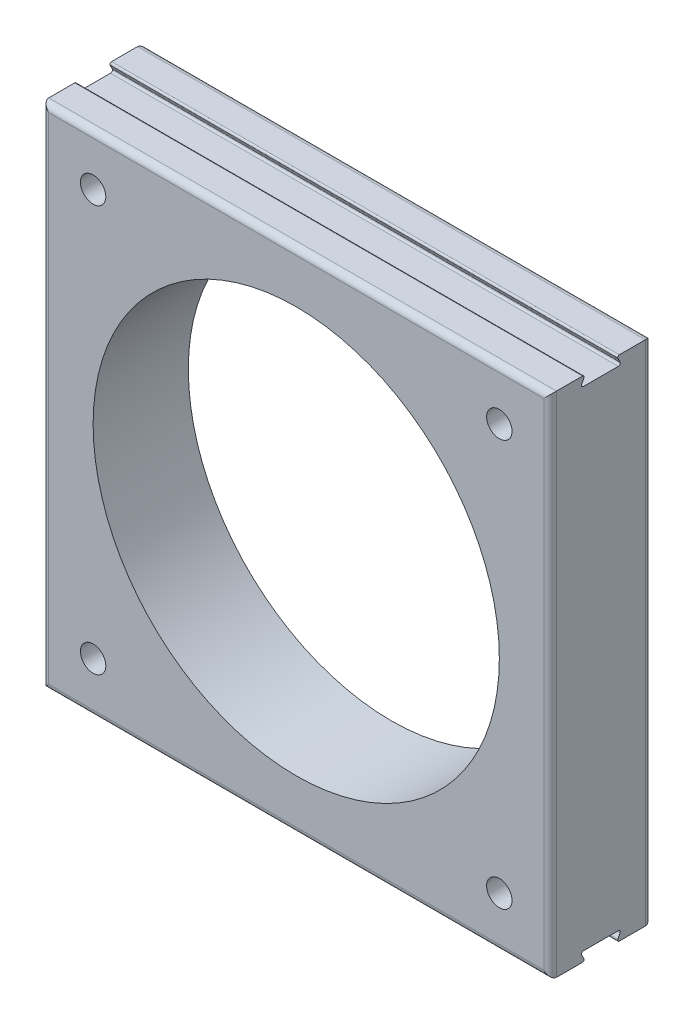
ISO-10303-21;
HEADER;
FILE_DESCRIPTION(('STEP AP214'),'2;1');
FILE_NAME('part.step','',(''),(''),'','','');
FILE_SCHEMA(('AUTOMOTIVE_DESIGN { 1 0 10303 214 1 1 1 1 }'));
ENDSEC;
DATA;
#1=APPLICATION_CONTEXT('core data for automotive mechanical design processes');
#2=APPLICATION_PROTOCOL_DEFINITION('international standard','automotive_design',2000,#1);
#3=PRODUCT_CONTEXT('',#1,'mechanical');
#4=PRODUCT('Part','Part','',(#3));
#5=PRODUCT_RELATED_PRODUCT_CATEGORY('part','',(#4));
#6=PRODUCT_DEFINITION_FORMATION('','',#4);
#7=PRODUCT_DEFINITION_CONTEXT('part definition',#1,'design');
#8=PRODUCT_DEFINITION('design','',#6,#7);
#9=PRODUCT_DEFINITION_SHAPE('','',#8);
#10=(LENGTH_UNIT() NAMED_UNIT(*) SI_UNIT(.MILLI.,.METRE.));
#11=(NAMED_UNIT(*) PLANE_ANGLE_UNIT() SI_UNIT($,.RADIAN.));
#12=(NAMED_UNIT(*) SI_UNIT($,.STERADIAN.) SOLID_ANGLE_UNIT());
#13=UNCERTAINTY_MEASURE_WITH_UNIT(LENGTH_MEASURE(1.E-05),#10,'distance_accuracy_value','');
#14=(GEOMETRIC_REPRESENTATION_CONTEXT(3) GLOBAL_UNCERTAINTY_ASSIGNED_CONTEXT((#13)) GLOBAL_UNIT_ASSIGNED_CONTEXT((#10,
#11,#12)) REPRESENTATION_CONTEXT('',''));
#15=CARTESIAN_POINT('',(0.,0.,0.));
#16=DIRECTION('',(0.,0.,1.));
#17=DIRECTION('',(1.,0.,0.));
#18=AXIS2_PLACEMENT_3D('',#15,#16,#17);
#19=CARTESIAN_POINT('',(-127.,127.,25.4));
#20=DIRECTION('',(0.,0.,1.));
#21=DIRECTION('',(1.,0.,0.));
#22=AXIS2_PLACEMENT_3D('',#19,#20,#21);
#23=PLANE('',#22);
#24=CARTESIAN_POINT('',(0.,0.,25.4));
#25=DIRECTION('',(0.,0.,-1.));
#26=DIRECTION('',(-1.,0.,0.));
#27=AXIS2_PLACEMENT_3D('',#24,#25,#26);
#28=CIRCLE('',#27,101.6);
#29=CARTESIAN_POINT('',(-101.6,0.,25.4));
#30=VERTEX_POINT('',#29);
#31=EDGE_CURVE('E454',#30,#30,#28,.T.);
#32=ORIENTED_EDGE('',*,*,#31,.T.);
#33=EDGE_LOOP('',(#32));
#34=FACE_BOUND('',#33,.T.);
#35=CARTESIAN_POINT('',(101.6,-101.6,25.4));
#36=DIRECTION('',(0.,0.,1.));
#37=DIRECTION('',(-1.,0.,0.));
#38=AXIS2_PLACEMENT_3D('',#35,#36,#37);
#39=CIRCLE('',#38,6.34999999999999);
#40=CARTESIAN_POINT('',(95.25,-101.6,25.4));
#41=VERTEX_POINT('',#40);
#42=EDGE_CURVE('E442',#41,#41,#39,.T.);
#43=ORIENTED_EDGE('',*,*,#42,.F.);
#44=EDGE_LOOP('',(#43));
#45=FACE_BOUND('',#44,.T.);
#46=CARTESIAN_POINT('',(-101.6,-101.6,25.4));
#47=DIRECTION('',(0.,0.,-1.));
#48=DIRECTION('',(1.,0.,0.));
#49=AXIS2_PLACEMENT_3D('',#46,#47,#48);
#50=CIRCLE('',#49,6.34999999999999);
#51=CARTESIAN_POINT('',(-95.25,-101.6,25.4));
#52=VERTEX_POINT('',#51);
#53=EDGE_CURVE('E430',#52,#52,#50,.T.);
#54=ORIENTED_EDGE('',*,*,#53,.T.);
#55=EDGE_LOOP('',(#54));
#56=FACE_BOUND('',#55,.T.);
#57=CARTESIAN_POINT('',(-101.6,101.6,25.4));
#58=DIRECTION('',(0.,0.,1.));
#59=DIRECTION('',(1.,0.,0.));
#60=AXIS2_PLACEMENT_3D('',#57,#58,#59);
#61=CIRCLE('',#60,6.34999999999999);
#62=CARTESIAN_POINT('',(-95.25,101.6,25.4));
#63=VERTEX_POINT('',#62);
#64=EDGE_CURVE('E424',#63,#63,#61,.T.);
#65=ORIENTED_EDGE('',*,*,#64,.F.);
#66=EDGE_LOOP('',(#65));
#67=FACE_BOUND('',#66,.T.);
#68=DIRECTION('',(0.,1.,0.));
#69=VECTOR('',#68,1.);
#70=CARTESIAN_POINT('',(123.825,127.,25.4));
#71=LINE('',#70,#69);
#72=CARTESIAN_POINT('',(123.825,-123.825,25.4));
#73=VERTEX_POINT('',#72);
#74=CARTESIAN_POINT('',(123.825,123.825,25.4));
#75=VERTEX_POINT('',#74);
#76=EDGE_CURVE('E336',#73,#75,#71,.T.);
#77=ORIENTED_EDGE('',*,*,#76,.T.);
#78=DIRECTION('',(1.,0.,0.));
#79=VECTOR('',#78,1.);
#80=CARTESIAN_POINT('',(-127.,123.825,25.4));
#81=LINE('',#80,#79);
#82=CARTESIAN_POINT('',(-123.825,123.825,25.4));
#83=VERTEX_POINT('',#82);
#84=EDGE_CURVE('E338',#75,#83,#81,.F.);
#85=ORIENTED_EDGE('',*,*,#84,.T.);
#86=DIRECTION('',(0.,-1.,0.));
#87=VECTOR('',#86,1.);
#88=CARTESIAN_POINT('',(-123.825,-127.,25.4));
#89=LINE('',#88,#87);
#90=CARTESIAN_POINT('',(-123.825,-123.825,25.4));
#91=VERTEX_POINT('',#90);
#92=EDGE_CURVE('E332',#83,#91,#89,.T.);
#93=ORIENTED_EDGE('',*,*,#92,.T.);
#94=DIRECTION('',(-1.,0.,0.));
#95=VECTOR('',#94,1.);
#96=CARTESIAN_POINT('',(-127.,-123.825,25.4));
#97=LINE('',#96,#95);
#98=EDGE_CURVE('E334',#91,#73,#97,.F.);
#99=ORIENTED_EDGE('',*,*,#98,.T.);
#100=EDGE_LOOP('',(#77,#85,#93,#99));
#101=FACE_BOUND('',#100,.T.);
#102=CARTESIAN_POINT('',(101.6,101.6,25.4));
#103=DIRECTION('',(0.,0.,-1.));
#104=DIRECTION('',(-1.,0.,0.));
#105=AXIS2_PLACEMENT_3D('',#102,#103,#104);
#106=CIRCLE('',#105,6.34999999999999);
#107=CARTESIAN_POINT('',(95.25,101.6,25.4));
#108=VERTEX_POINT('',#107);
#109=EDGE_CURVE('E436',#108,#108,#106,.T.);
#110=ORIENTED_EDGE('',*,*,#109,.T.);
#111=EDGE_LOOP('',(#110));
#112=FACE_BOUND('',#111,.T.);
#113=ADVANCED_FACE('F28',(#34,#45,#56,#67,#101,#112),#23,.T.);
#114=CARTESIAN_POINT('',(-127.,127.,-25.4));
#115=DIRECTION('',(0.,0.,1.));
#116=DIRECTION('',(1.,0.,0.));
#117=AXIS2_PLACEMENT_3D('',#114,#115,#116);
#118=PLANE('',#117);
#119=CARTESIAN_POINT('',(0.,0.,-25.4));
#120=DIRECTION('',(0.,0.,-1.));
#121=DIRECTION('',(-1.,0.,0.));
#122=AXIS2_PLACEMENT_3D('',#119,#120,#121);
#123=CIRCLE('',#122,107.95);
#124=CARTESIAN_POINT('',(-107.95,0.,-25.4));
#125=VERTEX_POINT('',#124);
#126=EDGE_CURVE('E448',#125,#125,#123,.T.);
#127=ORIENTED_EDGE('',*,*,#126,.F.);
#128=EDGE_LOOP('',(#127));
#129=FACE_BOUND('',#128,.T.);
#130=CARTESIAN_POINT('',(101.6,-101.6,-25.4));
#131=DIRECTION('',(0.,0.,1.));
#132=DIRECTION('',(-1.,0.,0.));
#133=AXIS2_PLACEMENT_3D('',#130,#131,#132);
#134=CIRCLE('',#133,6.34999999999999);
#135=CARTESIAN_POINT('',(95.25,-101.6,-25.4));
#136=VERTEX_POINT('',#135);
#137=EDGE_CURVE('E439',#136,#136,#134,.T.);
#138=ORIENTED_EDGE('',*,*,#137,.T.);
#139=EDGE_LOOP('',(#138));
#140=FACE_BOUND('',#139,.T.);
#141=CARTESIAN_POINT('',(-101.6,-101.6,-25.4));
#142=DIRECTION('',(0.,0.,-1.));
#143=DIRECTION('',(1.,0.,0.));
#144=AXIS2_PLACEMENT_3D('',#141,#142,#143);
#145=CIRCLE('',#144,6.34999999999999);
#146=CARTESIAN_POINT('',(-95.25,-101.6,-25.4));
#147=VERTEX_POINT('',#146);
#148=EDGE_CURVE('E427',#147,#147,#145,.T.);
#149=ORIENTED_EDGE('',*,*,#148,.F.);
#150=EDGE_LOOP('',(#149));
#151=FACE_BOUND('',#150,.T.);
#152=CARTESIAN_POINT('',(-101.6,101.6,-25.4));
#153=DIRECTION('',(0.,0.,1.));
#154=DIRECTION('',(1.,0.,0.));
#155=AXIS2_PLACEMENT_3D('',#152,#153,#154);
#156=CIRCLE('',#155,6.34999999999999);
#157=CARTESIAN_POINT('',(-95.25,101.6,-25.4));
#158=VERTEX_POINT('',#157);
#159=EDGE_CURVE('E421',#158,#158,#156,.T.);
#160=ORIENTED_EDGE('',*,*,#159,.T.);
#161=EDGE_LOOP('',(#160));
#162=FACE_BOUND('',#161,.T.);
#163=DIRECTION('',(0.,1.,0.));
#164=VECTOR('',#163,1.);
#165=CARTESIAN_POINT('',(123.825,127.,-25.4));
#166=LINE('',#165,#164);
#167=CARTESIAN_POINT('',(123.825,123.825,-25.4));
#168=VERTEX_POINT('',#167);
#169=CARTESIAN_POINT('',(123.825,-123.825,-25.4));
#170=VERTEX_POINT('',#169);
#171=EDGE_CURVE('E43',#168,#170,#166,.F.);
#172=ORIENTED_EDGE('',*,*,#171,.T.);
#173=DIRECTION('',(-1.,0.,0.));
#174=VECTOR('',#173,1.);
#175=CARTESIAN_POINT('',(-127.,-123.825,-25.4));
#176=LINE('',#175,#174);
#177=CARTESIAN_POINT('',(-123.825,-123.825,-25.4));
#178=VERTEX_POINT('',#177);
#179=EDGE_CURVE('E355',#170,#178,#176,.T.);
#180=ORIENTED_EDGE('',*,*,#179,.T.);
#181=DIRECTION('',(0.,-1.,0.));
#182=VECTOR('',#181,1.);
#183=CARTESIAN_POINT('',(-123.825,127.,-25.4));
#184=LINE('',#183,#182);
#185=CARTESIAN_POINT('',(-123.825,123.825,-25.4));
#186=VERTEX_POINT('',#185);
#187=EDGE_CURVE('E351',#178,#186,#184,.F.);
#188=ORIENTED_EDGE('',*,*,#187,.T.);
#189=DIRECTION('',(1.,0.,0.));
#190=VECTOR('',#189,1.);
#191=CARTESIAN_POINT('',(127.,123.825,-25.4));
#192=LINE('',#191,#190);
#193=EDGE_CURVE('E48',#186,#168,#192,.T.);
#194=ORIENTED_EDGE('',*,*,#193,.T.);
#195=EDGE_LOOP('',(#172,#180,#188,#194));
#196=FACE_BOUND('',#195,.T.);
#197=CARTESIAN_POINT('',(101.6,101.6,-25.4));
#198=DIRECTION('',(0.,0.,-1.));
#199=DIRECTION('',(-1.,0.,0.));
#200=AXIS2_PLACEMENT_3D('',#197,#198,#199);
#201=CIRCLE('',#200,6.34999999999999);
#202=CARTESIAN_POINT('',(95.25,101.6,-25.4));
#203=VERTEX_POINT('',#202);
#204=EDGE_CURVE('E433',#203,#203,#201,.T.);
#205=ORIENTED_EDGE('',*,*,#204,.F.);
#206=EDGE_LOOP('',(#205));
#207=FACE_BOUND('',#206,.T.);
#208=ADVANCED_FACE('F472',(#129,#140,#151,#162,#196,#207),#118,.F.);
#209=CARTESIAN_POINT('',(-127.,127.,25.4));
#210=DIRECTION('',(1.,0.,0.));
#211=DIRECTION('',(0.,0.,-1.));
#212=AXIS2_PLACEMENT_3D('',#209,#210,#211);
#213=PLANE('',#212);
#214=DIRECTION('',(0.,0.,-1.));
#215=VECTOR('',#214,1.);
#216=CARTESIAN_POINT('',(-127.,-127.,25.4));
#217=LINE('',#216,#215);
#218=CARTESIAN_POINT('',(-127.,-127.,22.225));
#219=VERTEX_POINT('',#218);
#220=CARTESIAN_POINT('',(-127.,-127.,9.20803888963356));
#221=VERTEX_POINT('',#220);
#222=EDGE_CURVE('E307',#219,#221,#217,.T.);
#223=ORIENTED_EDGE('',*,*,#222,.F.);
#224=DIRECTION('',(0.,-1.,0.));
#225=VECTOR('',#224,1.);
#226=CARTESIAN_POINT('',(-127.,127.,22.225));
#227=LINE('',#226,#225);
#228=CARTESIAN_POINT('',(-127.,127.,22.225));
#229=VERTEX_POINT('',#228);
#230=EDGE_CURVE('E349',#219,#229,#227,.F.);
#231=ORIENTED_EDGE('',*,*,#230,.T.);
#232=DIRECTION('',(0.,0.,-1.));
#233=VECTOR('',#232,1.);
#234=CARTESIAN_POINT('',(-127.,127.,25.4));
#235=LINE('',#234,#233);
#236=CARTESIAN_POINT('',(-127.,127.,9.20803888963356));
#237=VERTEX_POINT('',#236);
#238=EDGE_CURVE('E299',#229,#237,#235,.T.);
#239=ORIENTED_EDGE('',*,*,#238,.T.);
#240=CARTESIAN_POINT('',(-127.,126.20625,9.20803888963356));
#241=DIRECTION('',(1.,0.,0.));
#242=DIRECTION('',(0.,0.,-1.));
#243=AXIS2_PLACEMENT_3D('',#240,#241,#242);
#244=CIRCLE('',#243,0.79375);
#245=CARTESIAN_POINT('',(-127.,125.858154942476,8.49468841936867));
#246=VERTEX_POINT('',#245);
#247=EDGE_CURVE('E322',#237,#246,#244,.F.);
#248=ORIENTED_EDGE('',*,*,#247,.T.);
#249=DIRECTION('',(0.,-0.898709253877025,0.438544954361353));
#250=VECTOR('',#249,1.);
#251=CARTESIAN_POINT('',(-127.,127.,7.9375));
#252=LINE('',#251,#250);
#253=CARTESIAN_POINT('',(-127.,123.612719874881,9.59039786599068));
#254=VERTEX_POINT('',#253);
#255=EDGE_CURVE('E277',#246,#254,#252,.T.);
#256=ORIENTED_EDGE('',*,*,#255,.T.);
#257=CARTESIAN_POINT('',(-127.,123.193479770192,8.73125));
#258=DIRECTION('',(1.,0.,0.));
#259=DIRECTION('',(0.,0.,-1.));
#260=AXIS2_PLACEMENT_3D('',#257,#258,#259);
#261=CIRCLE('',#260,0.955979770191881);
#262=CARTESIAN_POINT('',(-127.,122.2375,8.73125));
#263=VERTEX_POINT('',#262);
#264=EDGE_CURVE('E279',#254,#263,#261,.T.);
#265=ORIENTED_EDGE('',*,*,#264,.T.);
#266=DIRECTION('',(0.,0.,1.));
#267=VECTOR('',#266,1.);
#268=CARTESIAN_POINT('',(-127.,122.2375,-8.73125));
#269=LINE('',#268,#267);
#270=CARTESIAN_POINT('',(-127.,122.2375,-8.73125));
#271=VERTEX_POINT('',#270);
#272=EDGE_CURVE('E282',#271,#263,#269,.T.);
#273=ORIENTED_EDGE('',*,*,#272,.F.);
#274=CARTESIAN_POINT('',(-127.,123.193479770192,-8.73125));
#275=DIRECTION('',(-1.,0.,0.));
#276=DIRECTION('',(0.,0.,1.));
#277=AXIS2_PLACEMENT_3D('',#274,#275,#276);
#278=CIRCLE('',#277,0.955979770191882);
#279=CARTESIAN_POINT('',(-127.,123.612719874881,-9.59039786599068));
#280=VERTEX_POINT('',#279);
#281=EDGE_CURVE('E284',#280,#271,#278,.T.);
#282=ORIENTED_EDGE('',*,*,#281,.F.);
#283=DIRECTION('',(0.,-0.898709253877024,-0.438544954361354));
#284=VECTOR('',#283,1.);
#285=CARTESIAN_POINT('',(-127.,127.,-7.9375));
#286=LINE('',#285,#284);
#287=CARTESIAN_POINT('',(-127.,125.858154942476,-8.49468841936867));
#288=VERTEX_POINT('',#287);
#289=EDGE_CURVE('E286',#288,#280,#286,.T.);
#290=ORIENTED_EDGE('',*,*,#289,.F.);
#291=CARTESIAN_POINT('',(-127.,126.20625,-9.20803888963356));
#292=DIRECTION('',(1.,0.,0.));
#293=DIRECTION('',(0.,0.,-1.));
#294=AXIS2_PLACEMENT_3D('',#291,#292,#293);
#295=CIRCLE('',#294,0.79375);
#296=CARTESIAN_POINT('',(-127.,127.,-9.20803888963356));
#297=VERTEX_POINT('',#296);
#298=EDGE_CURVE('E320',#288,#297,#295,.F.);
#299=ORIENTED_EDGE('',*,*,#298,.T.);
#300=CARTESIAN_POINT('',(-127.,127.,-22.225));
#301=VERTEX_POINT('',#300);
#302=EDGE_CURVE('E292',#297,#301,#235,.T.);
#303=ORIENTED_EDGE('',*,*,#302,.T.);
#304=DIRECTION('',(0.,-1.,0.));
#305=VECTOR('',#304,1.);
#306=CARTESIAN_POINT('',(-127.,127.,-22.225));
#307=LINE('',#306,#305);
#308=CARTESIAN_POINT('',(-127.,-127.,-22.225));
#309=VERTEX_POINT('',#308);
#310=EDGE_CURVE('E347',#301,#309,#307,.T.);
#311=ORIENTED_EDGE('',*,*,#310,.T.);
#312=CARTESIAN_POINT('',(-127.,-127.,-9.20803888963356));
#313=VERTEX_POINT('',#312);
#314=EDGE_CURVE('E211',#313,#309,#217,.T.);
#315=ORIENTED_EDGE('',*,*,#314,.F.);
#316=CARTESIAN_POINT('',(-127.,-126.20625,-9.20803888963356));
#317=DIRECTION('',(-1.,0.,0.));
#318=DIRECTION('',(0.,0.,-1.));
#319=AXIS2_PLACEMENT_3D('',#316,#317,#318);
#320=CIRCLE('',#319,0.79375);
#321=CARTESIAN_POINT('',(-127.,-125.858154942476,-8.49468841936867));
#322=VERTEX_POINT('',#321);
#323=EDGE_CURVE('E191',#322,#313,#320,.F.);
#324=ORIENTED_EDGE('',*,*,#323,.F.);
#325=DIRECTION('',(0.,0.898709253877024,-0.438544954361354));
#326=VECTOR('',#325,1.);
#327=CARTESIAN_POINT('',(-127.,-127.,-7.9375));
#328=LINE('',#327,#326);
#329=CARTESIAN_POINT('',(-127.,-123.612719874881,-9.59039786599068));
#330=VERTEX_POINT('',#329);
#331=EDGE_CURVE('E200',#322,#330,#328,.T.);
#332=ORIENTED_EDGE('',*,*,#331,.T.);
#333=CARTESIAN_POINT('',(-127.,-123.193479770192,-8.73125));
#334=DIRECTION('',(1.,0.,0.));
#335=DIRECTION('',(0.,0.,1.));
#336=AXIS2_PLACEMENT_3D('',#333,#334,#335);
#337=CIRCLE('',#336,0.955979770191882);
#338=CARTESIAN_POINT('',(-127.,-122.2375,-8.73125));
#339=VERTEX_POINT('',#338);
#340=EDGE_CURVE('E227',#330,#339,#337,.T.);
#341=ORIENTED_EDGE('',*,*,#340,.T.);
#342=DIRECTION('',(0.,0.,1.));
#343=VECTOR('',#342,1.);
#344=CARTESIAN_POINT('',(-127.,-122.2375,-8.73125));
#345=LINE('',#344,#343);
#346=CARTESIAN_POINT('',(-127.,-122.2375,8.73125));
#347=VERTEX_POINT('',#346);
#348=EDGE_CURVE('E234',#339,#347,#345,.T.);
#349=ORIENTED_EDGE('',*,*,#348,.T.);
#350=CARTESIAN_POINT('',(-127.,-123.193479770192,8.73125));
#351=DIRECTION('',(-1.,0.,0.));
#352=DIRECTION('',(0.,0.,-1.));
#353=AXIS2_PLACEMENT_3D('',#350,#351,#352);
#354=CIRCLE('',#353,0.955979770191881);
#355=CARTESIAN_POINT('',(-127.,-123.612719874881,9.59039786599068));
#356=VERTEX_POINT('',#355);
#357=EDGE_CURVE('E242',#356,#347,#354,.T.);
#358=ORIENTED_EDGE('',*,*,#357,.F.);
#359=DIRECTION('',(0.,0.898709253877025,0.438544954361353));
#360=VECTOR('',#359,1.);
#361=CARTESIAN_POINT('',(-127.,-127.,7.9375));
#362=LINE('',#361,#360);
#363=CARTESIAN_POINT('',(-127.,-125.858154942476,8.49468841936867));
#364=VERTEX_POINT('',#363);
#365=EDGE_CURVE('E247',#364,#356,#362,.T.);
#366=ORIENTED_EDGE('',*,*,#365,.F.);
#367=CARTESIAN_POINT('',(-127.,-126.20625,9.20803888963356));
#368=DIRECTION('',(-1.,0.,0.));
#369=DIRECTION('',(0.,0.,-1.));
#370=AXIS2_PLACEMENT_3D('',#367,#368,#369);
#371=CIRCLE('',#370,0.79375);
#372=EDGE_CURVE('E255',#221,#364,#371,.F.);
#373=ORIENTED_EDGE('',*,*,#372,.F.);
#374=EDGE_LOOP('',(#223,#231,#239,#248,#256,#265,#273,#282,#290,#299,#303,#311,#315,#324,#332,
#341,#349,#358,#366,#373));
#375=FACE_BOUND('',#374,.T.);
#376=ADVANCED_FACE('F30',(#375),#213,.F.);
#377=CARTESIAN_POINT('',(127.,-127.,25.4));
#378=DIRECTION('',(0.,-1.,0.));
#379=DIRECTION('',(1.,0.,0.));
#380=AXIS2_PLACEMENT_3D('',#377,#378,#379);
#381=PLANE('',#380);
#382=DIRECTION('',(0.,0.,-1.));
#383=VECTOR('',#382,1.);
#384=CARTESIAN_POINT('',(127.,-127.,25.4));
#385=LINE('',#384,#383);
#386=CARTESIAN_POINT('',(127.,-127.,22.225));
#387=VERTEX_POINT('',#386);
#388=CARTESIAN_POINT('',(127.,-127.,9.20803888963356));
#389=VERTEX_POINT('',#388);
#390=EDGE_CURVE('E305',#387,#389,#385,.T.);
#391=ORIENTED_EDGE('',*,*,#390,.F.);
#392=DIRECTION('',(-1.,0.,0.));
#393=VECTOR('',#392,1.);
#394=CARTESIAN_POINT('',(127.,-127.,22.225));
#395=LINE('',#394,#393);
#396=EDGE_CURVE('E345',#387,#219,#395,.T.);
#397=ORIENTED_EDGE('',*,*,#396,.T.);
#398=ORIENTED_EDGE('',*,*,#222,.T.);
#399=DIRECTION('',(1.,0.,0.));
#400=VECTOR('',#399,1.);
#401=CARTESIAN_POINT('',(-127.,-127.,9.20803888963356));
#402=LINE('',#401,#400);
#403=EDGE_CURVE('E258',#389,#221,#402,.F.);
#404=ORIENTED_EDGE('',*,*,#403,.F.);
#405=EDGE_LOOP('',(#391,#397,#398,#404));
#406=FACE_BOUND('',#405,.T.);
#407=ADVANCED_FACE('F393',(#406),#381,.T.);
#408=CARTESIAN_POINT('',(127.,-127.,25.4));
#409=DIRECTION('',(-1.,0.,0.));
#410=DIRECTION('',(0.,0.,1.));
#411=AXIS2_PLACEMENT_3D('',#408,#409,#410);
#412=PLANE('',#411);
#413=DIRECTION('',(0.,0.,-1.));
#414=VECTOR('',#413,1.);
#415=CARTESIAN_POINT('',(127.,127.,25.4));
#416=LINE('',#415,#414);
#417=CARTESIAN_POINT('',(127.,127.,22.225));
#418=VERTEX_POINT('',#417);
#419=CARTESIAN_POINT('',(127.,127.,9.20803888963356));
#420=VERTEX_POINT('',#419);
#421=EDGE_CURVE('E302',#418,#420,#416,.T.);
#422=ORIENTED_EDGE('',*,*,#421,.F.);
#423=DIRECTION('',(0.,1.,0.));
#424=VECTOR('',#423,1.);
#425=CARTESIAN_POINT('',(127.,-127.,22.225));
#426=LINE('',#425,#424);
#427=EDGE_CURVE('E343',#418,#387,#426,.F.);
#428=ORIENTED_EDGE('',*,*,#427,.T.);
#429=ORIENTED_EDGE('',*,*,#390,.T.);
#430=CARTESIAN_POINT('',(127.,-126.20625,9.20803888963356));
#431=DIRECTION('',(1.,0.,0.));
#432=DIRECTION('',(0.,0.,1.));
#433=AXIS2_PLACEMENT_3D('',#430,#431,#432);
#434=CIRCLE('',#433,0.79375);
#435=CARTESIAN_POINT('',(127.,-125.858154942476,8.49468841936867));
#436=VERTEX_POINT('',#435);
#437=EDGE_CURVE('E261',#436,#389,#434,.F.);
#438=ORIENTED_EDGE('',*,*,#437,.F.);
#439=DIRECTION('',(0.,0.898709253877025,0.438544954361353));
#440=VECTOR('',#439,1.);
#441=CARTESIAN_POINT('',(127.,-127.,7.9375));
#442=LINE('',#441,#440);
#443=CARTESIAN_POINT('',(127.,-123.612719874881,9.59039786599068));
#444=VERTEX_POINT('',#443);
#445=EDGE_CURVE('E252',#436,#444,#442,.T.);
#446=ORIENTED_EDGE('',*,*,#445,.T.);
#447=CARTESIAN_POINT('',(127.,-123.193479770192,8.73125));
#448=DIRECTION('',(-1.,0.,0.));
#449=DIRECTION('',(0.,0.,-1.));
#450=AXIS2_PLACEMENT_3D('',#447,#448,#449);
#451=CIRCLE('',#450,0.955979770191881);
#452=CARTESIAN_POINT('',(127.,-122.2375,8.73125));
#453=VERTEX_POINT('',#452);
#454=EDGE_CURVE('E239',#444,#453,#451,.T.);
#455=ORIENTED_EDGE('',*,*,#454,.T.);
#456=DIRECTION('',(0.,0.,1.));
#457=VECTOR('',#456,1.);
#458=CARTESIAN_POINT('',(127.,-122.2375,-8.73125));
#459=LINE('',#458,#457);
#460=CARTESIAN_POINT('',(127.,-122.2375,-8.73125));
#461=VERTEX_POINT('',#460);
#462=EDGE_CURVE('E231',#461,#453,#459,.T.);
#463=ORIENTED_EDGE('',*,*,#462,.F.);
#464=CARTESIAN_POINT('',(127.,-123.193479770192,-8.73125));
#465=DIRECTION('',(1.,0.,0.));
#466=DIRECTION('',(0.,0.,1.));
#467=AXIS2_PLACEMENT_3D('',#464,#465,#466);
#468=CIRCLE('',#467,0.955979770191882);
#469=CARTESIAN_POINT('',(127.,-123.612719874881,-9.59039786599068));
#470=VERTEX_POINT('',#469);
#471=EDGE_CURVE('E224',#470,#461,#468,.T.);
#472=ORIENTED_EDGE('',*,*,#471,.F.);
#473=DIRECTION('',(0.,0.898709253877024,-0.438544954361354));
#474=VECTOR('',#473,1.);
#475=CARTESIAN_POINT('',(127.,-127.,-7.9375));
#476=LINE('',#475,#474);
#477=CARTESIAN_POINT('',(127.,-125.858154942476,-8.49468841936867));
#478=VERTEX_POINT('',#477);
#479=EDGE_CURVE('E206',#478,#470,#476,.T.);
#480=ORIENTED_EDGE('',*,*,#479,.F.);
#481=CARTESIAN_POINT('',(127.,-126.20625,-9.20803888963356));
#482=DIRECTION('',(1.,0.,0.));
#483=DIRECTION('',(0.,0.,1.));
#484=AXIS2_PLACEMENT_3D('',#481,#482,#483);
#485=CIRCLE('',#484,0.79375);
#486=CARTESIAN_POINT('',(127.,-127.,-9.20803888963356));
#487=VERTEX_POINT('',#486);
#488=EDGE_CURVE('E194',#487,#478,#485,.F.);
#489=ORIENTED_EDGE('',*,*,#488,.F.);
#490=CARTESIAN_POINT('',(127.,-127.,-22.225));
#491=VERTEX_POINT('',#490);
#492=EDGE_CURVE('E304',#487,#491,#385,.T.);
#493=ORIENTED_EDGE('',*,*,#492,.T.);
#494=DIRECTION('',(0.,1.,0.));
#495=VECTOR('',#494,1.);
#496=CARTESIAN_POINT('',(127.,-127.,-22.225));
#497=LINE('',#496,#495);
#498=CARTESIAN_POINT('',(127.,127.,-22.225));
#499=VERTEX_POINT('',#498);
#500=EDGE_CURVE('E341',#491,#499,#497,.T.);
#501=ORIENTED_EDGE('',*,*,#500,.T.);
#502=CARTESIAN_POINT('',(127.,127.,-9.20803888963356));
#503=VERTEX_POINT('',#502);
#504=EDGE_CURVE('E301',#503,#499,#416,.T.);
#505=ORIENTED_EDGE('',*,*,#504,.F.);
#506=CARTESIAN_POINT('',(127.,126.20625,-9.20803888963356));
#507=DIRECTION('',(-1.,0.,0.));
#508=DIRECTION('',(0.,0.,1.));
#509=AXIS2_PLACEMENT_3D('',#506,#507,#508);
#510=CIRCLE('',#509,0.79375);
#511=CARTESIAN_POINT('',(127.,125.858154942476,-8.49468841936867));
#512=VERTEX_POINT('',#511);
#513=EDGE_CURVE('E312',#503,#512,#510,.F.);
#514=ORIENTED_EDGE('',*,*,#513,.T.);
#515=DIRECTION('',(0.,-0.898709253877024,-0.438544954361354));
#516=VECTOR('',#515,1.);
#517=CARTESIAN_POINT('',(127.,127.,-7.9375));
#518=LINE('',#517,#516);
#519=CARTESIAN_POINT('',(127.,123.612719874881,-9.59039786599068));
#520=VERTEX_POINT('',#519);
#521=EDGE_CURVE('E275',#512,#520,#518,.T.);
#522=ORIENTED_EDGE('',*,*,#521,.T.);
#523=CARTESIAN_POINT('',(127.,123.193479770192,-8.73125));
#524=DIRECTION('',(-1.,0.,0.));
#525=DIRECTION('',(0.,0.,1.));
#526=AXIS2_PLACEMENT_3D('',#523,#524,#525);
#527=CIRCLE('',#526,0.955979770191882);
#528=CARTESIAN_POINT('',(127.,122.2375,-8.73125));
#529=VERTEX_POINT('',#528);
#530=EDGE_CURVE('E272',#520,#529,#527,.T.);
#531=ORIENTED_EDGE('',*,*,#530,.T.);
#532=DIRECTION('',(0.,0.,1.));
#533=VECTOR('',#532,1.);
#534=CARTESIAN_POINT('',(127.,122.2375,-8.73125));
#535=LINE('',#534,#533);
#536=CARTESIAN_POINT('',(127.,122.2375,8.73125));
#537=VERTEX_POINT('',#536);
#538=EDGE_CURVE('E269',#529,#537,#535,.T.);
#539=ORIENTED_EDGE('',*,*,#538,.T.);
#540=CARTESIAN_POINT('',(127.,123.193479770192,8.73125));
#541=DIRECTION('',(1.,0.,0.));
#542=DIRECTION('',(0.,0.,-1.));
#543=AXIS2_PLACEMENT_3D('',#540,#541,#542);
#544=CIRCLE('',#543,0.955979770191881);
#545=CARTESIAN_POINT('',(127.,123.612719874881,9.59039786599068));
#546=VERTEX_POINT('',#545);
#547=EDGE_CURVE('E266',#546,#537,#544,.T.);
#548=ORIENTED_EDGE('',*,*,#547,.F.);
#549=DIRECTION('',(0.,-0.898709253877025,0.438544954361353));
#550=VECTOR('',#549,1.);
#551=CARTESIAN_POINT('',(127.,127.,7.9375));
#552=LINE('',#551,#550);
#553=CARTESIAN_POINT('',(127.,125.858154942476,8.49468841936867));
#554=VERTEX_POINT('',#553);
#555=EDGE_CURVE('E264',#554,#546,#552,.T.);
#556=ORIENTED_EDGE('',*,*,#555,.F.);
#557=CARTESIAN_POINT('',(127.,126.20625,9.20803888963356));
#558=DIRECTION('',(-1.,0.,0.));
#559=DIRECTION('',(0.,0.,1.));
#560=AXIS2_PLACEMENT_3D('',#557,#558,#559);
#561=CIRCLE('',#560,0.79375);
#562=EDGE_CURVE('E314',#554,#420,#561,.F.);
#563=ORIENTED_EDGE('',*,*,#562,.T.);
#564=EDGE_LOOP('',(#422,#428,#429,#438,#446,#455,#463,#472,#480,#489,#493,#501,#505,#514,#522,
#531,#539,#548,#556,#563));
#565=FACE_BOUND('',#564,.T.);
#566=ADVANCED_FACE('F366',(#565),#412,.F.);
#567=CARTESIAN_POINT('',(-127.,127.,25.4));
#568=DIRECTION('',(0.,1.,0.));
#569=DIRECTION('',(0.,0.,1.));
#570=AXIS2_PLACEMENT_3D('',#567,#568,#569);
#571=PLANE('',#570);
#572=ORIENTED_EDGE('',*,*,#504,.T.);
#573=DIRECTION('',(1.,0.,0.));
#574=VECTOR('',#573,1.);
#575=CARTESIAN_POINT('',(-127.,127.,-22.225));
#576=LINE('',#575,#574);
#577=EDGE_CURVE('E11',#499,#301,#576,.F.);
#578=ORIENTED_EDGE('',*,*,#577,.T.);
#579=ORIENTED_EDGE('',*,*,#302,.F.);
#580=DIRECTION('',(1.,0.,0.));
#581=VECTOR('',#580,1.);
#582=CARTESIAN_POINT('',(-127.,127.,-9.20803888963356));
#583=LINE('',#582,#581);
#584=EDGE_CURVE('E324',#297,#503,#583,.T.);
#585=ORIENTED_EDGE('',*,*,#584,.T.);
#586=EDGE_LOOP('',(#572,#578,#579,#585));
#587=FACE_BOUND('',#586,.T.);
#588=ADVANCED_FACE('F486',(#587),#571,.T.);
#589=ORIENTED_EDGE('',*,*,#314,.T.);
#590=DIRECTION('',(-1.,0.,0.));
#591=VECTOR('',#590,1.);
#592=CARTESIAN_POINT('',(127.,-127.,-22.225));
#593=LINE('',#592,#591);
#594=EDGE_CURVE('E36',#309,#491,#593,.F.);
#595=ORIENTED_EDGE('',*,*,#594,.T.);
#596=ORIENTED_EDGE('',*,*,#492,.F.);
#597=DIRECTION('',(1.,0.,0.));
#598=VECTOR('',#597,1.);
#599=CARTESIAN_POINT('',(-127.,-127.,-9.20803888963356));
#600=LINE('',#599,#598);
#601=EDGE_CURVE('E220',#313,#487,#600,.T.);
#602=ORIENTED_EDGE('',*,*,#601,.F.);
#603=EDGE_LOOP('',(#589,#595,#596,#602));
#604=FACE_BOUND('',#603,.T.);
#605=ADVANCED_FACE('F361',(#604),#381,.T.);
#606=ORIENTED_EDGE('',*,*,#238,.F.);
#607=DIRECTION('',(1.,0.,0.));
#608=VECTOR('',#607,1.);
#609=CARTESIAN_POINT('',(-127.,127.,22.225));
#610=LINE('',#609,#608);
#611=EDGE_CURVE('E329',#229,#418,#610,.T.);
#612=ORIENTED_EDGE('',*,*,#611,.T.);
#613=ORIENTED_EDGE('',*,*,#421,.T.);
#614=DIRECTION('',(1.,0.,0.));
#615=VECTOR('',#614,1.);
#616=CARTESIAN_POINT('',(-127.,127.,9.20803888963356));
#617=LINE('',#616,#615);
#618=EDGE_CURVE('E317',#420,#237,#617,.F.);
#619=ORIENTED_EDGE('',*,*,#618,.T.);
#620=EDGE_LOOP('',(#606,#612,#613,#619));
#621=FACE_BOUND('',#620,.T.);
#622=ADVANCED_FACE('F481',(#621),#571,.T.);
#623=CARTESIAN_POINT('',(-127.,127.,7.9375));
#624=DIRECTION('',(0.,0.438544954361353,0.898709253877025));
#625=DIRECTION('',(0.,-0.898709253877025,0.438544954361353));
#626=AXIS2_PLACEMENT_3D('',#623,#624,#625);
#627=PLANE('',#626);
#628=ORIENTED_EDGE('',*,*,#255,.F.);
#629=DIRECTION('',(1.,0.,0.));
#630=VECTOR('',#629,1.);
#631=CARTESIAN_POINT('',(127.,125.858154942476,8.49468841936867));
#632=LINE('',#631,#630);
#633=EDGE_CURVE('E309',#246,#554,#632,.T.);
#634=ORIENTED_EDGE('',*,*,#633,.T.);
#635=ORIENTED_EDGE('',*,*,#555,.T.);
#636=DIRECTION('',(1.,0.,0.));
#637=VECTOR('',#636,1.);
#638=CARTESIAN_POINT('',(-127.,123.612719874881,9.59039786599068));
#639=LINE('',#638,#637);
#640=EDGE_CURVE('E288',#254,#546,#639,.T.);
#641=ORIENTED_EDGE('',*,*,#640,.F.);
#642=EDGE_LOOP('',(#628,#634,#635,#641));
#643=FACE_BOUND('',#642,.T.);
#644=ADVANCED_FACE('F484',(#643),#627,.F.);
#645=CARTESIAN_POINT('',(-127.,127.,-7.9375));
#646=DIRECTION('',(0.,-0.438544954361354,0.898709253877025));
#647=DIRECTION('',(0.,-0.898709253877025,-0.438544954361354));
#648=AXIS2_PLACEMENT_3D('',#645,#646,#647);
#649=PLANE('',#648);
#650=ORIENTED_EDGE('',*,*,#521,.F.);
#651=DIRECTION('',(1.,0.,0.));
#652=VECTOR('',#651,1.);
#653=CARTESIAN_POINT('',(-127.,125.858154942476,-8.49468841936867));
#654=LINE('',#653,#652);
#655=EDGE_CURVE('E327',#512,#288,#654,.F.);
#656=ORIENTED_EDGE('',*,*,#655,.T.);
#657=ORIENTED_EDGE('',*,*,#289,.T.);
#658=DIRECTION('',(1.,0.,0.));
#659=VECTOR('',#658,1.);
#660=CARTESIAN_POINT('',(-127.,123.612719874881,-9.59039786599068));
#661=LINE('',#660,#659);
#662=EDGE_CURVE('E289',#280,#520,#661,.T.);
#663=ORIENTED_EDGE('',*,*,#662,.T.);
#664=EDGE_LOOP('',(#650,#656,#657,#663));
#665=FACE_BOUND('',#664,.T.);
#666=ADVANCED_FACE('F564',(#665),#649,.T.);
#667=CARTESIAN_POINT('',(-127.,123.193479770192,-8.73125));
#668=DIRECTION('',(1.,0.,0.));
#669=DIRECTION('',(0.,0.,-1.));
#670=AXIS2_PLACEMENT_3D('',#667,#668,#669);
#671=CYLINDRICAL_SURFACE('',#670,0.955979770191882);
#672=ORIENTED_EDGE('',*,*,#530,.F.);
#673=ORIENTED_EDGE('',*,*,#662,.F.);
#674=ORIENTED_EDGE('',*,*,#281,.T.);
#675=DIRECTION('',(1.,0.,0.));
#676=VECTOR('',#675,1.);
#677=CARTESIAN_POINT('',(-127.,122.2375,-8.73125));
#678=LINE('',#677,#676);
#679=EDGE_CURVE('E293',#271,#529,#678,.T.);
#680=ORIENTED_EDGE('',*,*,#679,.T.);
#681=EDGE_LOOP('',(#672,#673,#674,#680));
#682=FACE_BOUND('',#681,.T.);
#683=ADVANCED_FACE('F568',(#682),#671,.F.);
#684=CARTESIAN_POINT('',(-127.,122.2375,-8.73125));
#685=DIRECTION('',(0.,1.,0.));
#686=DIRECTION('',(0.,0.,1.));
#687=AXIS2_PLACEMENT_3D('',#684,#685,#686);
#688=PLANE('',#687);
#689=ORIENTED_EDGE('',*,*,#538,.F.);
#690=ORIENTED_EDGE('',*,*,#679,.F.);
#691=ORIENTED_EDGE('',*,*,#272,.T.);
#692=DIRECTION('',(1.,0.,0.));
#693=VECTOR('',#692,1.);
#694=CARTESIAN_POINT('',(-127.,122.2375,8.73125));
#695=LINE('',#694,#693);
#696=EDGE_CURVE('E295',#263,#537,#695,.T.);
#697=ORIENTED_EDGE('',*,*,#696,.T.);
#698=EDGE_LOOP('',(#689,#690,#691,#697));
#699=FACE_BOUND('',#698,.T.);
#700=ADVANCED_FACE('F583',(#699),#688,.T.);
#701=CARTESIAN_POINT('',(-127.,123.193479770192,8.73125));
#702=DIRECTION('',(1.,0.,0.));
#703=DIRECTION('',(0.,0.,-1.));
#704=AXIS2_PLACEMENT_3D('',#701,#702,#703);
#705=CYLINDRICAL_SURFACE('',#704,0.955979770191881);
#706=ORIENTED_EDGE('',*,*,#547,.T.);
#707=ORIENTED_EDGE('',*,*,#696,.F.);
#708=ORIENTED_EDGE('',*,*,#264,.F.);
#709=ORIENTED_EDGE('',*,*,#640,.T.);
#710=EDGE_LOOP('',(#706,#707,#708,#709));
#711=FACE_BOUND('',#710,.T.);
#712=ADVANCED_FACE('F558',(#711),#705,.F.);
#713=CARTESIAN_POINT('',(-127.,126.20625,9.20803888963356));
#714=DIRECTION('',(-1.,0.,0.));
#715=DIRECTION('',(0.,0.,1.));
#716=AXIS2_PLACEMENT_3D('',#713,#714,#715);
#717=CYLINDRICAL_SURFACE('',#716,0.79375);
#718=ORIENTED_EDGE('',*,*,#247,.F.);
#719=ORIENTED_EDGE('',*,*,#618,.F.);
#720=ORIENTED_EDGE('',*,*,#562,.F.);
#721=ORIENTED_EDGE('',*,*,#633,.F.);
#722=EDGE_LOOP('',(#718,#719,#720,#721));
#723=FACE_BOUND('',#722,.T.);
#724=ADVANCED_FACE('F549',(#723),#717,.T.);
#725=CARTESIAN_POINT('',(-127.,126.20625,-9.20803888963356));
#726=DIRECTION('',(1.,0.,0.));
#727=DIRECTION('',(0.,0.,-1.));
#728=AXIS2_PLACEMENT_3D('',#725,#726,#727);
#729=CYLINDRICAL_SURFACE('',#728,0.79375);
#730=ORIENTED_EDGE('',*,*,#298,.F.);
#731=ORIENTED_EDGE('',*,*,#655,.F.);
#732=ORIENTED_EDGE('',*,*,#513,.F.);
#733=ORIENTED_EDGE('',*,*,#584,.F.);
#734=EDGE_LOOP('',(#730,#731,#732,#733));
#735=FACE_BOUND('',#734,.T.);
#736=ADVANCED_FACE('F542',(#735),#729,.T.);
#737=CARTESIAN_POINT('',(-127.,-126.20625,9.20803888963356));
#738=DIRECTION('',(-1.,0.,0.));
#739=DIRECTION('',(0.,0.,1.));
#740=AXIS2_PLACEMENT_3D('',#737,#738,#739);
#741=CYLINDRICAL_SURFACE('',#740,0.79375);
#742=ORIENTED_EDGE('',*,*,#372,.T.);
#743=DIRECTION('',(1.,0.,0.));
#744=VECTOR('',#743,1.);
#745=CARTESIAN_POINT('',(127.,-125.858154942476,8.49468841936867));
#746=LINE('',#745,#744);
#747=EDGE_CURVE('E250',#364,#436,#746,.T.);
#748=ORIENTED_EDGE('',*,*,#747,.T.);
#749=ORIENTED_EDGE('',*,*,#437,.T.);
#750=ORIENTED_EDGE('',*,*,#403,.T.);
#751=EDGE_LOOP('',(#742,#748,#749,#750));
#752=FACE_BOUND('',#751,.T.);
#753=ADVANCED_FACE('F388',(#752),#741,.T.);
#754=CARTESIAN_POINT('',(-127.,-127.,7.9375));
#755=DIRECTION('',(0.,-0.438544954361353,0.898709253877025));
#756=DIRECTION('',(0.,0.898709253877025,0.438544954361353));
#757=AXIS2_PLACEMENT_3D('',#754,#755,#756);
#758=PLANE('',#757);
#759=ORIENTED_EDGE('',*,*,#365,.T.);
#760=DIRECTION('',(1.,0.,0.));
#761=VECTOR('',#760,1.);
#762=CARTESIAN_POINT('',(-127.,-123.612719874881,9.59039786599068));
#763=LINE('',#762,#761);
#764=EDGE_CURVE('E245',#356,#444,#763,.T.);
#765=ORIENTED_EDGE('',*,*,#764,.T.);
#766=ORIENTED_EDGE('',*,*,#445,.F.);
#767=ORIENTED_EDGE('',*,*,#747,.F.);
#768=EDGE_LOOP('',(#759,#765,#766,#767));
#769=FACE_BOUND('',#768,.T.);
#770=ADVANCED_FACE('F384',(#769),#758,.F.);
#771=CARTESIAN_POINT('',(-127.,-123.193479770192,8.73125));
#772=DIRECTION('',(1.,0.,0.));
#773=DIRECTION('',(0.,0.,-1.));
#774=AXIS2_PLACEMENT_3D('',#771,#772,#773);
#775=CYLINDRICAL_SURFACE('',#774,0.955979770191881);
#776=ORIENTED_EDGE('',*,*,#454,.F.);
#777=ORIENTED_EDGE('',*,*,#764,.F.);
#778=ORIENTED_EDGE('',*,*,#357,.T.);
#779=DIRECTION('',(1.,0.,0.));
#780=VECTOR('',#779,1.);
#781=CARTESIAN_POINT('',(-127.,-122.2375,8.73125));
#782=LINE('',#781,#780);
#783=EDGE_CURVE('E237',#347,#453,#782,.T.);
#784=ORIENTED_EDGE('',*,*,#783,.T.);
#785=EDGE_LOOP('',(#776,#777,#778,#784));
#786=FACE_BOUND('',#785,.T.);
#787=ADVANCED_FACE('F381',(#786),#775,.F.);
#788=CARTESIAN_POINT('',(-127.,-122.2375,-8.73125));
#789=DIRECTION('',(0.,-1.,0.));
#790=DIRECTION('',(0.,0.,1.));
#791=AXIS2_PLACEMENT_3D('',#788,#789,#790);
#792=PLANE('',#791);
#793=ORIENTED_EDGE('',*,*,#462,.T.);
#794=ORIENTED_EDGE('',*,*,#783,.F.);
#795=ORIENTED_EDGE('',*,*,#348,.F.);
#796=DIRECTION('',(1.,0.,0.));
#797=VECTOR('',#796,1.);
#798=CARTESIAN_POINT('',(-127.,-122.2375,-8.73125));
#799=LINE('',#798,#797);
#800=EDGE_CURVE('E229',#339,#461,#799,.T.);
#801=ORIENTED_EDGE('',*,*,#800,.T.);
#802=EDGE_LOOP('',(#793,#794,#795,#801));
#803=FACE_BOUND('',#802,.T.);
#804=ADVANCED_FACE('F378',(#803),#792,.T.);
#805=CARTESIAN_POINT('',(-127.,-123.193479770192,-8.73125));
#806=DIRECTION('',(1.,0.,0.));
#807=DIRECTION('',(0.,0.,-1.));
#808=AXIS2_PLACEMENT_3D('',#805,#806,#807);
#809=CYLINDRICAL_SURFACE('',#808,0.955979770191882);
#810=ORIENTED_EDGE('',*,*,#471,.T.);
#811=ORIENTED_EDGE('',*,*,#800,.F.);
#812=ORIENTED_EDGE('',*,*,#340,.F.);
#813=DIRECTION('',(1.,0.,0.));
#814=VECTOR('',#813,1.);
#815=CARTESIAN_POINT('',(-127.,-123.612719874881,-9.59039786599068));
#816=LINE('',#815,#814);
#817=EDGE_CURVE('E202',#330,#470,#816,.T.);
#818=ORIENTED_EDGE('',*,*,#817,.T.);
#819=EDGE_LOOP('',(#810,#811,#812,#818));
#820=FACE_BOUND('',#819,.T.);
#821=ADVANCED_FACE('F373',(#820),#809,.F.);
#822=CARTESIAN_POINT('',(-127.,-127.,-7.9375));
#823=DIRECTION('',(0.,0.438544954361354,0.898709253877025));
#824=DIRECTION('',(0.,0.898709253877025,-0.438544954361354));
#825=AXIS2_PLACEMENT_3D('',#822,#823,#824);
#826=PLANE('',#825);
#827=ORIENTED_EDGE('',*,*,#479,.T.);
#828=ORIENTED_EDGE('',*,*,#817,.F.);
#829=ORIENTED_EDGE('',*,*,#331,.F.);
#830=DIRECTION('',(1.,0.,0.));
#831=VECTOR('',#830,1.);
#832=CARTESIAN_POINT('',(-127.,-125.858154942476,-8.49468841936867));
#833=LINE('',#832,#831);
#834=EDGE_CURVE('E187',#478,#322,#833,.F.);
#835=ORIENTED_EDGE('',*,*,#834,.F.);
#836=EDGE_LOOP('',(#827,#828,#829,#835));
#837=FACE_BOUND('',#836,.T.);
#838=ADVANCED_FACE('F201',(#837),#826,.T.);
#839=CARTESIAN_POINT('',(-127.,-126.20625,-9.20803888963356));
#840=DIRECTION('',(1.,0.,0.));
#841=DIRECTION('',(0.,0.,-1.));
#842=AXIS2_PLACEMENT_3D('',#839,#840,#841);
#843=CYLINDRICAL_SURFACE('',#842,0.79375);
#844=ORIENTED_EDGE('',*,*,#323,.T.);
#845=ORIENTED_EDGE('',*,*,#601,.T.);
#846=ORIENTED_EDGE('',*,*,#488,.T.);
#847=ORIENTED_EDGE('',*,*,#834,.T.);
#848=EDGE_LOOP('',(#844,#845,#846,#847));
#849=FACE_BOUND('',#848,.T.);
#850=ADVANCED_FACE('F189',(#849),#843,.T.);
#851=CARTESIAN_POINT('',(127.,-123.825,22.225));
#852=DIRECTION('',(-1.,0.,0.));
#853=DIRECTION('',(0.,-1.,0.));
#854=AXIS2_PLACEMENT_3D('',#851,#852,#853);
#855=CYLINDRICAL_SURFACE('',#854,3.175);
#856=CARTESIAN_POINT('',(123.825,-123.825,22.225));
#857=DIRECTION('',(-0.707106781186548,-0.707106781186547,0.));
#858=DIRECTION('',(-0.707106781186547,0.707106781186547,0.));
#859=AXIS2_PLACEMENT_3D('',#856,#857,#858);
#860=ELLIPSE('',#859,4.49012806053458,3.175);
#861=EDGE_CURVE('E215',#73,#387,#860,.F.);
#862=ORIENTED_EDGE('',*,*,#861,.F.);
#863=ORIENTED_EDGE('',*,*,#98,.F.);
#864=CARTESIAN_POINT('',(-123.825,-123.825,22.225));
#865=DIRECTION('',(-0.707106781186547,0.707106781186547,0.));
#866=DIRECTION('',(0.707106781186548,0.707106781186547,0.));
#867=AXIS2_PLACEMENT_3D('',#864,#865,#866);
#868=ELLIPSE('',#867,4.49012806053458,3.175);
#869=EDGE_CURVE('E212',#219,#91,#868,.T.);
#870=ORIENTED_EDGE('',*,*,#869,.F.);
#871=ORIENTED_EDGE('',*,*,#396,.F.);
#872=EDGE_LOOP('',(#862,#863,#870,#871));
#873=FACE_BOUND('',#872,.T.);
#874=ADVANCED_FACE('F398',(#873),#855,.T.);
#875=CARTESIAN_POINT('',(-123.825,127.,22.225));
#876=DIRECTION('',(0.,1.,0.));
#877=DIRECTION('',(0.,0.,1.));
#878=AXIS2_PLACEMENT_3D('',#875,#876,#877);
#879=CYLINDRICAL_SURFACE('',#878,3.175);
#880=ORIENTED_EDGE('',*,*,#869,.T.);
#881=ORIENTED_EDGE('',*,*,#92,.F.);
#882=CARTESIAN_POINT('',(-123.825,123.825,22.225));
#883=DIRECTION('',(0.707106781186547,0.707106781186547,0.));
#884=DIRECTION('',(-0.707106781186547,0.707106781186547,0.));
#885=AXIS2_PLACEMENT_3D('',#882,#883,#884);
#886=ELLIPSE('',#885,4.49012806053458,3.175);
#887=EDGE_CURVE('E406',#229,#83,#886,.T.);
#888=ORIENTED_EDGE('',*,*,#887,.F.);
#889=ORIENTED_EDGE('',*,*,#230,.F.);
#890=EDGE_LOOP('',(#880,#881,#888,#889));
#891=FACE_BOUND('',#890,.T.);
#892=ADVANCED_FACE('F604',(#891),#879,.T.);
#893=CARTESIAN_POINT('',(123.825,127.,22.225));
#894=DIRECTION('',(0.,-1.,0.));
#895=DIRECTION('',(0.,0.,-1.));
#896=AXIS2_PLACEMENT_3D('',#893,#894,#895);
#897=CYLINDRICAL_SURFACE('',#896,3.175);
#898=ORIENTED_EDGE('',*,*,#861,.T.);
#899=ORIENTED_EDGE('',*,*,#427,.F.);
#900=CARTESIAN_POINT('',(123.825,123.825,22.225));
#901=DIRECTION('',(0.707106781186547,-0.707106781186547,0.));
#902=DIRECTION('',(-0.707106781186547,-0.707106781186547,0.));
#903=AXIS2_PLACEMENT_3D('',#900,#901,#902);
#904=ELLIPSE('',#903,4.49012806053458,3.175);
#905=EDGE_CURVE('E407',#75,#418,#904,.F.);
#906=ORIENTED_EDGE('',*,*,#905,.F.);
#907=ORIENTED_EDGE('',*,*,#76,.F.);
#908=EDGE_LOOP('',(#898,#899,#906,#907));
#909=FACE_BOUND('',#908,.T.);
#910=ADVANCED_FACE('F404',(#909),#897,.T.);
#911=CARTESIAN_POINT('',(-127.,123.825,22.225));
#912=DIRECTION('',(1.,0.,0.));
#913=DIRECTION('',(0.,0.,-1.));
#914=AXIS2_PLACEMENT_3D('',#911,#912,#913);
#915=CYLINDRICAL_SURFACE('',#914,3.175);
#916=ORIENTED_EDGE('',*,*,#887,.T.);
#917=ORIENTED_EDGE('',*,*,#84,.F.);
#918=ORIENTED_EDGE('',*,*,#905,.T.);
#919=ORIENTED_EDGE('',*,*,#611,.F.);
#920=EDGE_LOOP('',(#916,#917,#918,#919));
#921=FACE_BOUND('',#920,.T.);
#922=ADVANCED_FACE('F610',(#921),#915,.T.);
#923=CARTESIAN_POINT('',(-127.,123.825,-22.225));
#924=DIRECTION('',(-1.,0.,0.));
#925=DIRECTION('',(0.,0.,1.));
#926=AXIS2_PLACEMENT_3D('',#923,#924,#925);
#927=CYLINDRICAL_SURFACE('',#926,3.175);
#928=CARTESIAN_POINT('',(-123.825,123.825,-22.225));
#929=DIRECTION('',(-0.707106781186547,-0.707106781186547,0.));
#930=DIRECTION('',(0.707106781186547,-0.707106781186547,0.));
#931=AXIS2_PLACEMENT_3D('',#928,#929,#930);
#932=ELLIPSE('',#931,4.49012806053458,3.175);
#933=EDGE_CURVE('E414',#301,#186,#932,.T.);
#934=ORIENTED_EDGE('',*,*,#933,.F.);
#935=ORIENTED_EDGE('',*,*,#577,.F.);
#936=CARTESIAN_POINT('',(123.825,123.825,-22.225));
#937=DIRECTION('',(-0.707106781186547,0.707106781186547,0.));
#938=DIRECTION('',(-0.707106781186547,-0.707106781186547,0.));
#939=AXIS2_PLACEMENT_3D('',#936,#937,#938);
#940=ELLIPSE('',#939,4.49012806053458,3.175);
#941=EDGE_CURVE('E411',#168,#499,#940,.F.);
#942=ORIENTED_EDGE('',*,*,#941,.F.);
#943=ORIENTED_EDGE('',*,*,#193,.F.);
#944=EDGE_LOOP('',(#934,#935,#942,#943));
#945=FACE_BOUND('',#944,.T.);
#946=ADVANCED_FACE('F613',(#945),#927,.T.);
#947=CARTESIAN_POINT('',(123.825,-127.,-22.225));
#948=DIRECTION('',(0.,1.,0.));
#949=DIRECTION('',(0.,0.,1.));
#950=AXIS2_PLACEMENT_3D('',#947,#948,#949);
#951=CYLINDRICAL_SURFACE('',#950,3.175);
#952=ORIENTED_EDGE('',*,*,#941,.T.);
#953=ORIENTED_EDGE('',*,*,#500,.F.);
#954=CARTESIAN_POINT('',(123.825,-123.825,-22.225));
#955=DIRECTION('',(0.707106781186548,0.707106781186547,0.));
#956=DIRECTION('',(-0.707106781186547,0.707106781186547,0.));
#957=AXIS2_PLACEMENT_3D('',#954,#955,#956);
#958=ELLIPSE('',#957,4.49012806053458,3.175);
#959=EDGE_CURVE('E417',#170,#491,#958,.F.);
#960=ORIENTED_EDGE('',*,*,#959,.F.);
#961=ORIENTED_EDGE('',*,*,#171,.F.);
#962=EDGE_LOOP('',(#952,#953,#960,#961));
#963=FACE_BOUND('',#962,.T.);
#964=ADVANCED_FACE('F617',(#963),#951,.T.);
#965=CARTESIAN_POINT('',(-123.825,127.,-22.225));
#966=DIRECTION('',(0.,-1.,0.));
#967=DIRECTION('',(0.,0.,-1.));
#968=AXIS2_PLACEMENT_3D('',#965,#966,#967);
#969=CYLINDRICAL_SURFACE('',#968,3.175);
#970=ORIENTED_EDGE('',*,*,#933,.T.);
#971=ORIENTED_EDGE('',*,*,#187,.F.);
#972=CARTESIAN_POINT('',(-123.825,-123.825,-22.225));
#973=DIRECTION('',(0.707106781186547,-0.707106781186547,0.));
#974=DIRECTION('',(-0.707106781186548,-0.707106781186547,0.));
#975=AXIS2_PLACEMENT_3D('',#972,#973,#974);
#976=ELLIPSE('',#975,4.49012806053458,3.175);
#977=EDGE_CURVE('E419',#309,#178,#976,.T.);
#978=ORIENTED_EDGE('',*,*,#977,.F.);
#979=ORIENTED_EDGE('',*,*,#310,.F.);
#980=EDGE_LOOP('',(#970,#971,#978,#979));
#981=FACE_BOUND('',#980,.T.);
#982=ADVANCED_FACE('F621',(#981),#969,.T.);
#983=CARTESIAN_POINT('',(-127.,-123.825,-22.225));
#984=DIRECTION('',(1.,0.,0.));
#985=DIRECTION('',(0.,1.,0.));
#986=AXIS2_PLACEMENT_3D('',#983,#984,#985);
#987=CYLINDRICAL_SURFACE('',#986,3.175);
#988=ORIENTED_EDGE('',*,*,#959,.T.);
#989=ORIENTED_EDGE('',*,*,#594,.F.);
#990=ORIENTED_EDGE('',*,*,#977,.T.);
#991=ORIENTED_EDGE('',*,*,#179,.F.);
#992=EDGE_LOOP('',(#988,#989,#990,#991));
#993=FACE_BOUND('',#992,.T.);
#994=ADVANCED_FACE('F625',(#993),#987,.T.);
#995=CARTESIAN_POINT('',(-101.6,101.6,-25.4));
#996=DIRECTION('',(0.,0.,1.));
#997=DIRECTION('',(1.,0.,0.));
#998=AXIS2_PLACEMENT_3D('',#995,#996,#997);
#999=CYLINDRICAL_SURFACE('',#998,6.34999999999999);
#1000=ORIENTED_EDGE('',*,*,#159,.F.);
#1001=EDGE_LOOP('',(#1000));
#1002=FACE_BOUND('',#1001,.T.);
#1003=ORIENTED_EDGE('',*,*,#64,.T.);
#1004=EDGE_LOOP('',(#1003));
#1005=FACE_BOUND('',#1004,.T.);
#1006=ADVANCED_FACE('F629',(#1002,#1005),#999,.F.);
#1007=CARTESIAN_POINT('',(-101.6,-101.6,-25.4));
#1008=DIRECTION('',(0.,0.,1.));
#1009=DIRECTION('',(1.,0.,0.));
#1010=AXIS2_PLACEMENT_3D('',#1007,#1008,#1009);
#1011=CYLINDRICAL_SURFACE('',#1010,6.34999999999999);
#1012=ORIENTED_EDGE('',*,*,#148,.T.);
#1013=EDGE_LOOP('',(#1012));
#1014=FACE_BOUND('',#1013,.T.);
#1015=ORIENTED_EDGE('',*,*,#53,.F.);
#1016=EDGE_LOOP('',(#1015));
#1017=FACE_BOUND('',#1016,.T.);
#1018=ADVANCED_FACE('F632',(#1014,#1017),#1011,.F.);
#1019=CARTESIAN_POINT('',(101.6,101.6,-25.4));
#1020=DIRECTION('',(0.,0.,1.));
#1021=DIRECTION('',(1.,0.,0.));
#1022=AXIS2_PLACEMENT_3D('',#1019,#1020,#1021);
#1023=CYLINDRICAL_SURFACE('',#1022,6.34999999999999);
#1024=ORIENTED_EDGE('',*,*,#204,.T.);
#1025=EDGE_LOOP('',(#1024));
#1026=FACE_BOUND('',#1025,.T.);
#1027=ORIENTED_EDGE('',*,*,#109,.F.);
#1028=EDGE_LOOP('',(#1027));
#1029=FACE_BOUND('',#1028,.T.);
#1030=ADVANCED_FACE('F636',(#1026,#1029),#1023,.F.);
#1031=CARTESIAN_POINT('',(101.6,-101.6,-25.4));
#1032=DIRECTION('',(0.,0.,1.));
#1033=DIRECTION('',(1.,0.,0.));
#1034=AXIS2_PLACEMENT_3D('',#1031,#1032,#1033);
#1035=CYLINDRICAL_SURFACE('',#1034,6.34999999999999);
#1036=ORIENTED_EDGE('',*,*,#137,.F.);
#1037=EDGE_LOOP('',(#1036));
#1038=FACE_BOUND('',#1037,.T.);
#1039=ORIENTED_EDGE('',*,*,#42,.T.);
#1040=EDGE_LOOP('',(#1039));
#1041=FACE_BOUND('',#1040,.T.);
#1042=ADVANCED_FACE('F640',(#1038,#1041),#1035,.F.);
#1043=CARTESIAN_POINT('',(0.,0.,-22.225));
#1044=DIRECTION('',(0.,0.,-1.));
#1045=DIRECTION('',(-1.,0.,0.));
#1046=AXIS2_PLACEMENT_3D('',#1043,#1044,#1045);
#1047=CYLINDRICAL_SURFACE('',#1046,107.95);
#1048=CARTESIAN_POINT('',(0.,0.,-22.225));
#1049=DIRECTION('',(0.,0.,-1.));
#1050=DIRECTION('',(-1.,0.,0.));
#1051=AXIS2_PLACEMENT_3D('',#1048,#1049,#1050);
#1052=CIRCLE('',#1051,107.95);
#1053=CARTESIAN_POINT('',(-107.95,0.,-22.225));
#1054=VERTEX_POINT('',#1053);
#1055=EDGE_CURVE('E445',#1054,#1054,#1052,.T.);
#1056=ORIENTED_EDGE('',*,*,#1055,.F.);
#1057=EDGE_LOOP('',(#1056));
#1058=FACE_BOUND('',#1057,.T.);
#1059=ORIENTED_EDGE('',*,*,#126,.T.);
#1060=EDGE_LOOP('',(#1059));
#1061=FACE_BOUND('',#1060,.T.);
#1062=ADVANCED_FACE('F469',(#1058,#1061),#1047,.F.);
#1063=CARTESIAN_POINT('',(0.,0.,-22.225));
#1064=DIRECTION('',(0.,0.,-1.));
#1065=DIRECTION('',(-1.,0.,0.));
#1066=AXIS2_PLACEMENT_3D('',#1063,#1064,#1065);
#1067=PLANE('',#1066);
#1068=CARTESIAN_POINT('',(0.,0.,-22.225));
#1069=DIRECTION('',(0.,0.,-1.));
#1070=DIRECTION('',(-1.,0.,0.));
#1071=AXIS2_PLACEMENT_3D('',#1068,#1069,#1070);
#1072=CIRCLE('',#1071,101.6);
#1073=CARTESIAN_POINT('',(-101.6,0.,-22.225));
#1074=VERTEX_POINT('',#1073);
#1075=EDGE_CURVE('E451',#1074,#1074,#1072,.T.);
#1076=ORIENTED_EDGE('',*,*,#1075,.F.);
#1077=EDGE_LOOP('',(#1076));
#1078=FACE_BOUND('',#1077,.T.);
#1079=ORIENTED_EDGE('',*,*,#1055,.T.);
#1080=EDGE_LOOP('',(#1079));
#1081=FACE_BOUND('',#1080,.T.);
#1082=ADVANCED_FACE('F462',(#1078,#1081),#1067,.T.);
#1083=CARTESIAN_POINT('',(0.,0.,25.4));
#1084=DIRECTION('',(0.,0.,-1.));
#1085=DIRECTION('',(-1.,0.,0.));
#1086=AXIS2_PLACEMENT_3D('',#1083,#1084,#1085);
#1087=CYLINDRICAL_SURFACE('',#1086,101.6);
#1088=ORIENTED_EDGE('',*,*,#1075,.T.);
#1089=EDGE_LOOP('',(#1088));
#1090=FACE_BOUND('',#1089,.T.);
#1091=ORIENTED_EDGE('',*,*,#31,.F.);
#1092=EDGE_LOOP('',(#1091));
#1093=FACE_BOUND('',#1092,.T.);
#1094=ADVANCED_FACE('F460',(#1090,#1093),#1087,.F.);
#1095=CLOSED_SHELL('',(#113,#208,#376,#407,#566,#588,#605,#622,#644,#666,#683,#700,#712,#724,
#736,#753,#770,#787,#804,#821,#838,#850,#874,#892,#910,#922,#946,#964,#982,#994,#1006,#1018,
#1030,#1042,#1062,#1082,#1094));
#1096=MANIFOLD_SOLID_BREP('B2',#1095);
#1097=ADVANCED_BREP_SHAPE_REPRESENTATION('',(#18,#1096),#14);
#1098=SHAPE_DEFINITION_REPRESENTATION(#9,#1097);
ENDSEC;
END-ISO-10303-21;
